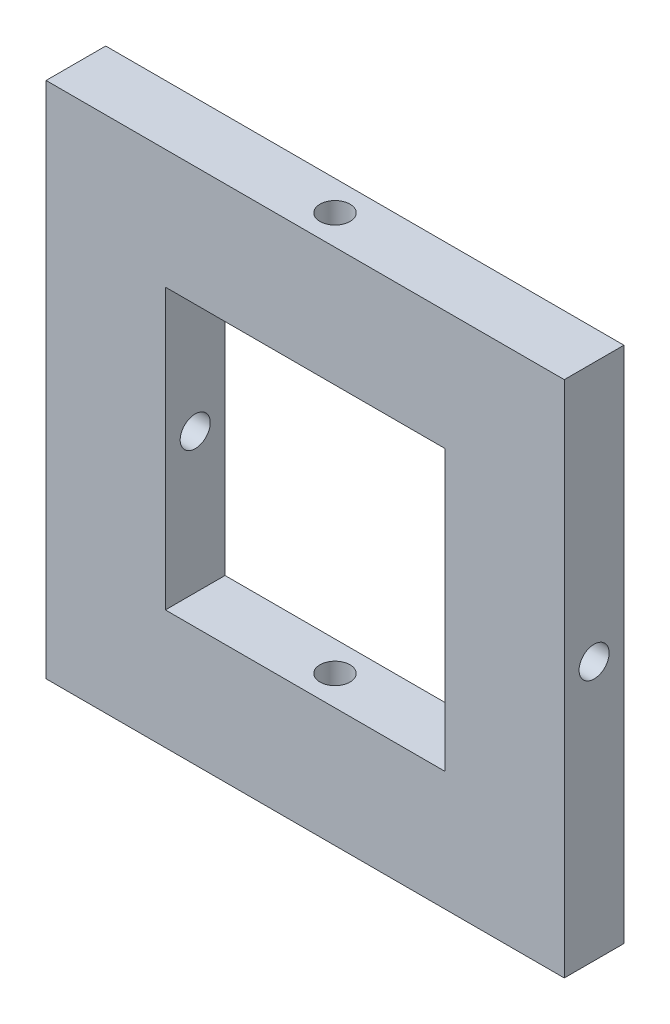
ISO-10303-21;
HEADER;
FILE_DESCRIPTION(('STEP AP214'),'2;1');
FILE_NAME('part.step','',(''),(''),'','','');
FILE_SCHEMA(('AUTOMOTIVE_DESIGN { 1 0 10303 214 1 1 1 1 }'));
ENDSEC;
DATA;
#1=APPLICATION_CONTEXT('core data for automotive mechanical design processes');
#2=APPLICATION_PROTOCOL_DEFINITION('international standard','automotive_design',2000,#1);
#3=PRODUCT_CONTEXT('',#1,'mechanical');
#4=PRODUCT('Part','Part','',(#3));
#5=PRODUCT_RELATED_PRODUCT_CATEGORY('part','',(#4));
#6=PRODUCT_DEFINITION_FORMATION('','',#4);
#7=PRODUCT_DEFINITION_CONTEXT('part definition',#1,'design');
#8=PRODUCT_DEFINITION('design','',#6,#7);
#9=PRODUCT_DEFINITION_SHAPE('','',#8);
#10=(LENGTH_UNIT() NAMED_UNIT(*) SI_UNIT(.MILLI.,.METRE.));
#11=(NAMED_UNIT(*) PLANE_ANGLE_UNIT() SI_UNIT($,.RADIAN.));
#12=(NAMED_UNIT(*) SI_UNIT($,.STERADIAN.) SOLID_ANGLE_UNIT());
#13=UNCERTAINTY_MEASURE_WITH_UNIT(LENGTH_MEASURE(1.E-05),#10,'distance_accuracy_value','');
#14=(GEOMETRIC_REPRESENTATION_CONTEXT(3) GLOBAL_UNCERTAINTY_ASSIGNED_CONTEXT((#13)) GLOBAL_UNIT_ASSIGNED_CONTEXT((#10,
#11,#12)) REPRESENTATION_CONTEXT('',''));
#15=CARTESIAN_POINT('',(0.,0.,0.));
#16=DIRECTION('',(0.,0.,1.));
#17=DIRECTION('',(1.,0.,0.));
#18=AXIS2_PLACEMENT_3D('',#15,#16,#17);
#19=CARTESIAN_POINT('',(55.16,55.16,12.7));
#20=DIRECTION('',(0.,0.,-1.));
#21=DIRECTION('',(-1.,0.,0.));
#22=AXIS2_PLACEMENT_3D('',#19,#20,#21);
#23=PLANE('',#22);
#24=DIRECTION('',(-1.,0.,0.));
#25=VECTOR('',#24,1.);
#26=CARTESIAN_POINT('',(-55.16,55.16,12.7));
#27=LINE('',#26,#25);
#28=CARTESIAN_POINT('',(55.16,55.16,12.7));
#29=VERTEX_POINT('',#28);
#30=CARTESIAN_POINT('',(-55.16,55.16,12.7));
#31=VERTEX_POINT('',#30);
#32=EDGE_CURVE('E142',#29,#31,#27,.T.);
#33=ORIENTED_EDGE('',*,*,#32,.T.);
#34=DIRECTION('',(0.,-1.,0.));
#35=VECTOR('',#34,1.);
#36=CARTESIAN_POINT('',(-55.16,-55.16,12.7));
#37=LINE('',#36,#35);
#38=CARTESIAN_POINT('',(-55.16,-55.16,12.7));
#39=VERTEX_POINT('',#38);
#40=EDGE_CURVE('E145',#31,#39,#37,.T.);
#41=ORIENTED_EDGE('',*,*,#40,.T.);
#42=DIRECTION('',(1.,0.,0.));
#43=VECTOR('',#42,1.);
#44=CARTESIAN_POINT('',(0.,-55.16,12.7));
#45=LINE('',#44,#43);
#46=CARTESIAN_POINT('',(55.16,-55.16,12.7));
#47=VERTEX_POINT('',#46);
#48=EDGE_CURVE('E147',#39,#47,#45,.T.);
#49=ORIENTED_EDGE('',*,*,#48,.T.);
#50=DIRECTION('',(0.,1.,0.));
#51=VECTOR('',#50,1.);
#52=CARTESIAN_POINT('',(55.16,55.16,12.7));
#53=LINE('',#52,#51);
#54=EDGE_CURVE('E149',#47,#29,#53,.T.);
#55=ORIENTED_EDGE('',*,*,#54,.T.);
#56=EDGE_LOOP('',(#33,#41,#49,#55));
#57=FACE_BOUND('',#56,.T.);
#58=DIRECTION('',(0.,-1.,0.));
#59=VECTOR('',#58,1.);
#60=CARTESIAN_POINT('',(-29.76,-29.76,12.7));
#61=LINE('',#60,#59);
#62=CARTESIAN_POINT('',(-29.76,29.76,12.7));
#63=VERTEX_POINT('',#62);
#64=CARTESIAN_POINT('',(-29.76,-29.76,12.7));
#65=VERTEX_POINT('',#64);
#66=EDGE_CURVE('E110',#63,#65,#61,.T.);
#67=ORIENTED_EDGE('',*,*,#66,.F.);
#68=DIRECTION('',(-1.,0.,0.));
#69=VECTOR('',#68,1.);
#70=CARTESIAN_POINT('',(-29.76,29.76,12.7));
#71=LINE('',#70,#69);
#72=CARTESIAN_POINT('',(29.76,29.76,12.7));
#73=VERTEX_POINT('',#72);
#74=EDGE_CURVE('E123',#73,#63,#71,.T.);
#75=ORIENTED_EDGE('',*,*,#74,.F.);
#76=DIRECTION('',(0.,1.,0.));
#77=VECTOR('',#76,1.);
#78=CARTESIAN_POINT('',(29.76,29.76,12.7));
#79=LINE('',#78,#77);
#80=CARTESIAN_POINT('',(29.76,-29.76,12.7));
#81=VERTEX_POINT('',#80);
#82=EDGE_CURVE('E128',#81,#73,#79,.T.);
#83=ORIENTED_EDGE('',*,*,#82,.F.);
#84=DIRECTION('',(1.,0.,0.));
#85=VECTOR('',#84,1.);
#86=CARTESIAN_POINT('',(0.,-29.76,12.7));
#87=LINE('',#86,#85);
#88=EDGE_CURVE('E126',#65,#81,#87,.T.);
#89=ORIENTED_EDGE('',*,*,#88,.F.);
#90=EDGE_LOOP('',(#67,#75,#83,#89));
#91=FACE_BOUND('',#90,.T.);
#92=ADVANCED_FACE('F26',(#57,#91),#23,.F.);
#93=CARTESIAN_POINT('',(55.16,55.16,0.));
#94=DIRECTION('',(0.,0.,-1.));
#95=DIRECTION('',(-1.,0.,0.));
#96=AXIS2_PLACEMENT_3D('',#93,#94,#95);
#97=PLANE('',#96);
#98=DIRECTION('',(0.,-1.,0.));
#99=VECTOR('',#98,1.);
#100=CARTESIAN_POINT('',(-55.16,-55.16,0.));
#101=LINE('',#100,#99);
#102=CARTESIAN_POINT('',(-55.16,55.16,0.));
#103=VERTEX_POINT('',#102);
#104=CARTESIAN_POINT('',(-55.16,-55.16,0.));
#105=VERTEX_POINT('',#104);
#106=EDGE_CURVE('E133',#103,#105,#101,.T.);
#107=ORIENTED_EDGE('',*,*,#106,.F.);
#108=DIRECTION('',(-1.,0.,0.));
#109=VECTOR('',#108,1.);
#110=CARTESIAN_POINT('',(0.,55.16,0.));
#111=LINE('',#110,#109);
#112=CARTESIAN_POINT('',(55.16,55.16,0.));
#113=VERTEX_POINT('',#112);
#114=EDGE_CURVE('E140',#113,#103,#111,.T.);
#115=ORIENTED_EDGE('',*,*,#114,.F.);
#116=DIRECTION('',(0.,1.,0.));
#117=VECTOR('',#116,1.);
#118=CARTESIAN_POINT('',(55.16,55.16,0.));
#119=LINE('',#118,#117);
#120=CARTESIAN_POINT('',(55.16,-55.16,0.));
#121=VERTEX_POINT('',#120);
#122=EDGE_CURVE('E138',#121,#113,#119,.T.);
#123=ORIENTED_EDGE('',*,*,#122,.F.);
#124=DIRECTION('',(1.,0.,0.));
#125=VECTOR('',#124,1.);
#126=CARTESIAN_POINT('',(55.16,-55.16,0.));
#127=LINE('',#126,#125);
#128=EDGE_CURVE('E136',#105,#121,#127,.T.);
#129=ORIENTED_EDGE('',*,*,#128,.F.);
#130=EDGE_LOOP('',(#107,#115,#123,#129));
#131=FACE_BOUND('',#130,.T.);
#132=DIRECTION('',(-1.,0.,0.));
#133=VECTOR('',#132,1.);
#134=CARTESIAN_POINT('',(0.,29.76,0.));
#135=LINE('',#134,#133);
#136=CARTESIAN_POINT('',(29.76,29.76,0.));
#137=VERTEX_POINT('',#136);
#138=CARTESIAN_POINT('',(-29.76,29.76,0.));
#139=VERTEX_POINT('',#138);
#140=EDGE_CURVE('E113',#137,#139,#135,.T.);
#141=ORIENTED_EDGE('',*,*,#140,.T.);
#142=DIRECTION('',(0.,-1.,0.));
#143=VECTOR('',#142,1.);
#144=CARTESIAN_POINT('',(-29.76,-29.76,0.));
#145=LINE('',#144,#143);
#146=CARTESIAN_POINT('',(-29.76,-29.76,0.));
#147=VERTEX_POINT('',#146);
#148=EDGE_CURVE('E104',#139,#147,#145,.T.);
#149=ORIENTED_EDGE('',*,*,#148,.T.);
#150=DIRECTION('',(1.,0.,0.));
#151=VECTOR('',#150,1.);
#152=CARTESIAN_POINT('',(29.76,-29.76,0.));
#153=LINE('',#152,#151);
#154=CARTESIAN_POINT('',(29.76,-29.76,0.));
#155=VERTEX_POINT('',#154);
#156=EDGE_CURVE('E92',#147,#155,#153,.T.);
#157=ORIENTED_EDGE('',*,*,#156,.T.);
#158=DIRECTION('',(0.,1.,0.));
#159=VECTOR('',#158,1.);
#160=CARTESIAN_POINT('',(29.76,29.76,0.));
#161=LINE('',#160,#159);
#162=EDGE_CURVE('E103',#155,#137,#161,.T.);
#163=ORIENTED_EDGE('',*,*,#162,.T.);
#164=EDGE_LOOP('',(#141,#149,#157,#163));
#165=FACE_BOUND('',#164,.T.);
#166=ADVANCED_FACE('F112',(#131,#165),#97,.T.);
#167=CARTESIAN_POINT('',(-55.16,-55.16,12.7));
#168=DIRECTION('',(1.,0.,0.));
#169=DIRECTION('',(0.,0.,-1.));
#170=AXIS2_PLACEMENT_3D('',#167,#168,#169);
#171=PLANE('',#170);
#172=CARTESIAN_POINT('',(-55.16,0.,6.35));
#173=DIRECTION('',(1.,0.,0.));
#174=DIRECTION('',(0.,0.,-1.));
#175=AXIS2_PLACEMENT_3D('',#172,#173,#174);
#176=CIRCLE('',#175,3.2);
#177=CARTESIAN_POINT('',(-55.16,0.,3.15));
#178=VERTEX_POINT('',#177);
#179=EDGE_CURVE('E162',#178,#178,#176,.T.);
#180=ORIENTED_EDGE('',*,*,#179,.T.);
#181=EDGE_LOOP('',(#180));
#182=FACE_BOUND('',#181,.T.);
#183=ORIENTED_EDGE('',*,*,#106,.T.);
#184=DIRECTION('',(0.,0.,-1.));
#185=VECTOR('',#184,1.);
#186=CARTESIAN_POINT('',(-55.16,-55.16,12.7));
#187=LINE('',#186,#185);
#188=EDGE_CURVE('E35',#39,#105,#187,.T.);
#189=ORIENTED_EDGE('',*,*,#188,.F.);
#190=ORIENTED_EDGE('',*,*,#40,.F.);
#191=DIRECTION('',(0.,0.,-1.));
#192=VECTOR('',#191,1.);
#193=CARTESIAN_POINT('',(-55.16,55.16,12.7));
#194=LINE('',#193,#192);
#195=EDGE_CURVE('E11',#31,#103,#194,.T.);
#196=ORIENTED_EDGE('',*,*,#195,.T.);
#197=EDGE_LOOP('',(#183,#189,#190,#196));
#198=FACE_BOUND('',#197,.T.);
#199=ADVANCED_FACE('F28',(#182,#198),#171,.F.);
#200=CARTESIAN_POINT('',(55.16,-55.16,12.7));
#201=DIRECTION('',(0.,1.,0.));
#202=DIRECTION('',(0.,0.,1.));
#203=AXIS2_PLACEMENT_3D('',#200,#201,#202);
#204=PLANE('',#203);
#205=CARTESIAN_POINT('',(0.,-55.16,6.35));
#206=DIRECTION('',(0.,1.,0.));
#207=DIRECTION('',(0.,0.,1.));
#208=AXIS2_PLACEMENT_3D('',#205,#206,#207);
#209=CIRCLE('',#208,3.2);
#210=CARTESIAN_POINT('',(0.,-55.16,9.55));
#211=VERTEX_POINT('',#210);
#212=EDGE_CURVE('E114',#211,#211,#209,.T.);
#213=ORIENTED_EDGE('',*,*,#212,.T.);
#214=EDGE_LOOP('',(#213));
#215=FACE_BOUND('',#214,.T.);
#216=ORIENTED_EDGE('',*,*,#128,.T.);
#217=DIRECTION('',(0.,0.,-1.));
#218=VECTOR('',#217,1.);
#219=CARTESIAN_POINT('',(55.16,-55.16,12.7));
#220=LINE('',#219,#218);
#221=EDGE_CURVE('E155',#47,#121,#220,.T.);
#222=ORIENTED_EDGE('',*,*,#221,.F.);
#223=ORIENTED_EDGE('',*,*,#48,.F.);
#224=ORIENTED_EDGE('',*,*,#188,.T.);
#225=EDGE_LOOP('',(#216,#222,#223,#224));
#226=FACE_BOUND('',#225,.T.);
#227=ADVANCED_FACE('F212',(#215,#226),#204,.F.);
#228=CARTESIAN_POINT('',(55.16,55.16,12.7));
#229=DIRECTION('',(-1.,0.,0.));
#230=DIRECTION('',(0.,0.,1.));
#231=AXIS2_PLACEMENT_3D('',#228,#229,#230);
#232=PLANE('',#231);
#233=CARTESIAN_POINT('',(55.16,0.,6.35));
#234=DIRECTION('',(-1.,0.,0.));
#235=DIRECTION('',(0.,0.,1.));
#236=AXIS2_PLACEMENT_3D('',#233,#234,#235);
#237=CIRCLE('',#236,3.2);
#238=CARTESIAN_POINT('',(55.16,0.,9.55));
#239=VERTEX_POINT('',#238);
#240=EDGE_CURVE('E168',#239,#239,#237,.T.);
#241=ORIENTED_EDGE('',*,*,#240,.T.);
#242=EDGE_LOOP('',(#241));
#243=FACE_BOUND('',#242,.T.);
#244=ORIENTED_EDGE('',*,*,#122,.T.);
#245=DIRECTION('',(0.,0.,-1.));
#246=VECTOR('',#245,1.);
#247=CARTESIAN_POINT('',(55.16,55.16,12.7));
#248=LINE('',#247,#246);
#249=EDGE_CURVE('E152',#29,#113,#248,.T.);
#250=ORIENTED_EDGE('',*,*,#249,.F.);
#251=ORIENTED_EDGE('',*,*,#54,.F.);
#252=ORIENTED_EDGE('',*,*,#221,.T.);
#253=EDGE_LOOP('',(#244,#250,#251,#252));
#254=FACE_BOUND('',#253,.T.);
#255=ADVANCED_FACE('F210',(#243,#254),#232,.F.);
#256=CARTESIAN_POINT('',(0.,55.16,12.7));
#257=DIRECTION('',(0.,-1.,0.));
#258=DIRECTION('',(0.,0.,-1.));
#259=AXIS2_PLACEMENT_3D('',#256,#257,#258);
#260=PLANE('',#259);
#261=CARTESIAN_POINT('',(0.,55.16,6.35));
#262=DIRECTION('',(0.,-1.,0.));
#263=DIRECTION('',(0.,0.,-1.));
#264=AXIS2_PLACEMENT_3D('',#261,#262,#263);
#265=CIRCLE('',#264,3.2);
#266=CARTESIAN_POINT('',(0.,55.16,3.15));
#267=VERTEX_POINT('',#266);
#268=EDGE_CURVE('E117',#267,#267,#265,.T.);
#269=ORIENTED_EDGE('',*,*,#268,.T.);
#270=EDGE_LOOP('',(#269));
#271=FACE_BOUND('',#270,.T.);
#272=ORIENTED_EDGE('',*,*,#114,.T.);
#273=ORIENTED_EDGE('',*,*,#195,.F.);
#274=ORIENTED_EDGE('',*,*,#32,.F.);
#275=ORIENTED_EDGE('',*,*,#249,.T.);
#276=EDGE_LOOP('',(#272,#273,#274,#275));
#277=FACE_BOUND('',#276,.T.);
#278=ADVANCED_FACE('F179',(#271,#277),#260,.F.);
#279=CARTESIAN_POINT('',(-29.76,-29.76,12.7));
#280=DIRECTION('',(1.,0.,0.));
#281=DIRECTION('',(0.,0.,-1.));
#282=AXIS2_PLACEMENT_3D('',#279,#280,#281);
#283=PLANE('',#282);
#284=CARTESIAN_POINT('',(-29.76,0.,6.35));
#285=DIRECTION('',(1.,0.,0.));
#286=DIRECTION('',(0.,0.,-1.));
#287=AXIS2_PLACEMENT_3D('',#284,#285,#286);
#288=CIRCLE('',#287,3.2);
#289=CARTESIAN_POINT('',(-29.76,0.,3.15));
#290=VERTEX_POINT('',#289);
#291=EDGE_CURVE('E173',#290,#290,#288,.T.);
#292=ORIENTED_EDGE('',*,*,#291,.F.);
#293=EDGE_LOOP('',(#292));
#294=FACE_BOUND('',#293,.T.);
#295=ORIENTED_EDGE('',*,*,#148,.F.);
#296=DIRECTION('',(0.,0.,-1.));
#297=VECTOR('',#296,1.);
#298=CARTESIAN_POINT('',(-29.76,29.76,12.7));
#299=LINE('',#298,#297);
#300=EDGE_CURVE('E48',#63,#139,#299,.T.);
#301=ORIENTED_EDGE('',*,*,#300,.F.);
#302=ORIENTED_EDGE('',*,*,#66,.T.);
#303=DIRECTION('',(0.,0.,-1.));
#304=VECTOR('',#303,1.);
#305=CARTESIAN_POINT('',(-29.76,-29.76,12.7));
#306=LINE('',#305,#304);
#307=EDGE_CURVE('E95',#65,#147,#306,.T.);
#308=ORIENTED_EDGE('',*,*,#307,.T.);
#309=EDGE_LOOP('',(#295,#301,#302,#308));
#310=FACE_BOUND('',#309,.T.);
#311=ADVANCED_FACE('F107',(#294,#310),#283,.T.);
#312=CARTESIAN_POINT('',(29.76,-29.76,12.7));
#313=DIRECTION('',(0.,1.,0.));
#314=DIRECTION('',(0.,0.,1.));
#315=AXIS2_PLACEMENT_3D('',#312,#313,#314);
#316=PLANE('',#315);
#317=CARTESIAN_POINT('',(0.,-29.76,6.35));
#318=DIRECTION('',(0.,1.,0.));
#319=DIRECTION('',(0.,0.,1.));
#320=AXIS2_PLACEMENT_3D('',#317,#318,#319);
#321=CIRCLE('',#320,3.2);
#322=CARTESIAN_POINT('',(0.,-29.76,9.55));
#323=VERTEX_POINT('',#322);
#324=EDGE_CURVE('E161',#323,#323,#321,.T.);
#325=ORIENTED_EDGE('',*,*,#324,.F.);
#326=EDGE_LOOP('',(#325));
#327=FACE_BOUND('',#326,.T.);
#328=ORIENTED_EDGE('',*,*,#156,.F.);
#329=ORIENTED_EDGE('',*,*,#307,.F.);
#330=ORIENTED_EDGE('',*,*,#88,.T.);
#331=DIRECTION('',(0.,0.,-1.));
#332=VECTOR('',#331,1.);
#333=CARTESIAN_POINT('',(29.76,-29.76,12.7));
#334=LINE('',#333,#332);
#335=EDGE_CURVE('E98',#81,#155,#334,.T.);
#336=ORIENTED_EDGE('',*,*,#335,.T.);
#337=EDGE_LOOP('',(#328,#329,#330,#336));
#338=FACE_BOUND('',#337,.T.);
#339=ADVANCED_FACE('F94',(#327,#338),#316,.T.);
#340=CARTESIAN_POINT('',(29.76,29.76,12.7));
#341=DIRECTION('',(-1.,0.,0.));
#342=DIRECTION('',(0.,0.,1.));
#343=AXIS2_PLACEMENT_3D('',#340,#341,#342);
#344=PLANE('',#343);
#345=CARTESIAN_POINT('',(29.76,0.,6.35));
#346=DIRECTION('',(-1.,0.,0.));
#347=DIRECTION('',(0.,0.,1.));
#348=AXIS2_PLACEMENT_3D('',#345,#346,#347);
#349=CIRCLE('',#348,3.2);
#350=CARTESIAN_POINT('',(29.76,0.,9.55));
#351=VERTEX_POINT('',#350);
#352=EDGE_CURVE('E30',#351,#351,#349,.T.);
#353=ORIENTED_EDGE('',*,*,#352,.F.);
#354=EDGE_LOOP('',(#353));
#355=FACE_BOUND('',#354,.T.);
#356=ORIENTED_EDGE('',*,*,#162,.F.);
#357=ORIENTED_EDGE('',*,*,#335,.F.);
#358=ORIENTED_EDGE('',*,*,#82,.T.);
#359=DIRECTION('',(0.,0.,-1.));
#360=VECTOR('',#359,1.);
#361=CARTESIAN_POINT('',(29.76,29.76,12.7));
#362=LINE('',#361,#360);
#363=EDGE_CURVE('E43',#73,#137,#362,.T.);
#364=ORIENTED_EDGE('',*,*,#363,.T.);
#365=EDGE_LOOP('',(#356,#357,#358,#364));
#366=FACE_BOUND('',#365,.T.);
#367=ADVANCED_FACE('F193',(#355,#366),#344,.T.);
#368=CARTESIAN_POINT('',(0.,29.76,12.7));
#369=DIRECTION('',(0.,-1.,0.));
#370=DIRECTION('',(0.,0.,-1.));
#371=AXIS2_PLACEMENT_3D('',#368,#369,#370);
#372=PLANE('',#371);
#373=CARTESIAN_POINT('',(0.,29.76,6.35));
#374=DIRECTION('',(0.,-1.,0.));
#375=DIRECTION('',(0.,0.,-1.));
#376=AXIS2_PLACEMENT_3D('',#373,#374,#375);
#377=CIRCLE('',#376,3.2);
#378=CARTESIAN_POINT('',(0.,29.76,3.15));
#379=VERTEX_POINT('',#378);
#380=EDGE_CURVE('E159',#379,#379,#377,.T.);
#381=ORIENTED_EDGE('',*,*,#380,.F.);
#382=EDGE_LOOP('',(#381));
#383=FACE_BOUND('',#382,.T.);
#384=ORIENTED_EDGE('',*,*,#140,.F.);
#385=ORIENTED_EDGE('',*,*,#363,.F.);
#386=ORIENTED_EDGE('',*,*,#74,.T.);
#387=ORIENTED_EDGE('',*,*,#300,.T.);
#388=EDGE_LOOP('',(#384,#385,#386,#387));
#389=FACE_BOUND('',#388,.T.);
#390=ADVANCED_FACE('F185',(#383,#389),#372,.T.);
#391=CARTESIAN_POINT('',(0.,-56.35,6.35));
#392=DIRECTION('',(0.,1.,0.));
#393=DIRECTION('',(0.,0.,1.));
#394=AXIS2_PLACEMENT_3D('',#391,#392,#393);
#395=CYLINDRICAL_SURFACE('',#394,3.2);
#396=ORIENTED_EDGE('',*,*,#380,.T.);
#397=EDGE_LOOP('',(#396));
#398=FACE_BOUND('',#397,.T.);
#399=ORIENTED_EDGE('',*,*,#268,.F.);
#400=EDGE_LOOP('',(#399));
#401=FACE_BOUND('',#400,.T.);
#402=ADVANCED_FACE('F182',(#398,#401),#395,.F.);
#403=ORIENTED_EDGE('',*,*,#324,.T.);
#404=EDGE_LOOP('',(#403));
#405=FACE_BOUND('',#404,.T.);
#406=ORIENTED_EDGE('',*,*,#212,.F.);
#407=EDGE_LOOP('',(#406));
#408=FACE_BOUND('',#407,.T.);
#409=ADVANCED_FACE('F184',(#405,#408),#395,.F.);
#410=CARTESIAN_POINT('',(-56.35,0.,6.35));
#411=DIRECTION('',(1.,0.,0.));
#412=DIRECTION('',(0.,0.,-1.));
#413=AXIS2_PLACEMENT_3D('',#410,#411,#412);
#414=CYLINDRICAL_SURFACE('',#413,3.2);
#415=ORIENTED_EDGE('',*,*,#352,.T.);
#416=EDGE_LOOP('',(#415));
#417=FACE_BOUND('',#416,.T.);
#418=ORIENTED_EDGE('',*,*,#240,.F.);
#419=EDGE_LOOP('',(#418));
#420=FACE_BOUND('',#419,.T.);
#421=ADVANCED_FACE('F191',(#417,#420),#414,.F.);
#422=ORIENTED_EDGE('',*,*,#291,.T.);
#423=EDGE_LOOP('',(#422));
#424=FACE_BOUND('',#423,.T.);
#425=ORIENTED_EDGE('',*,*,#179,.F.);
#426=EDGE_LOOP('',(#425));
#427=FACE_BOUND('',#426,.T.);
#428=ADVANCED_FACE('F267',(#424,#427),#414,.F.);
#429=CLOSED_SHELL('',(#92,#166,#199,#227,#255,#278,#311,#339,#367,#390,#402,#409,#421,#428));
#430=MANIFOLD_SOLID_BREP('B2',#429);
#431=ADVANCED_BREP_SHAPE_REPRESENTATION('',(#18,#430),#14);
#432=SHAPE_DEFINITION_REPRESENTATION(#9,#431);
ENDSEC;
END-ISO-10303-21;
